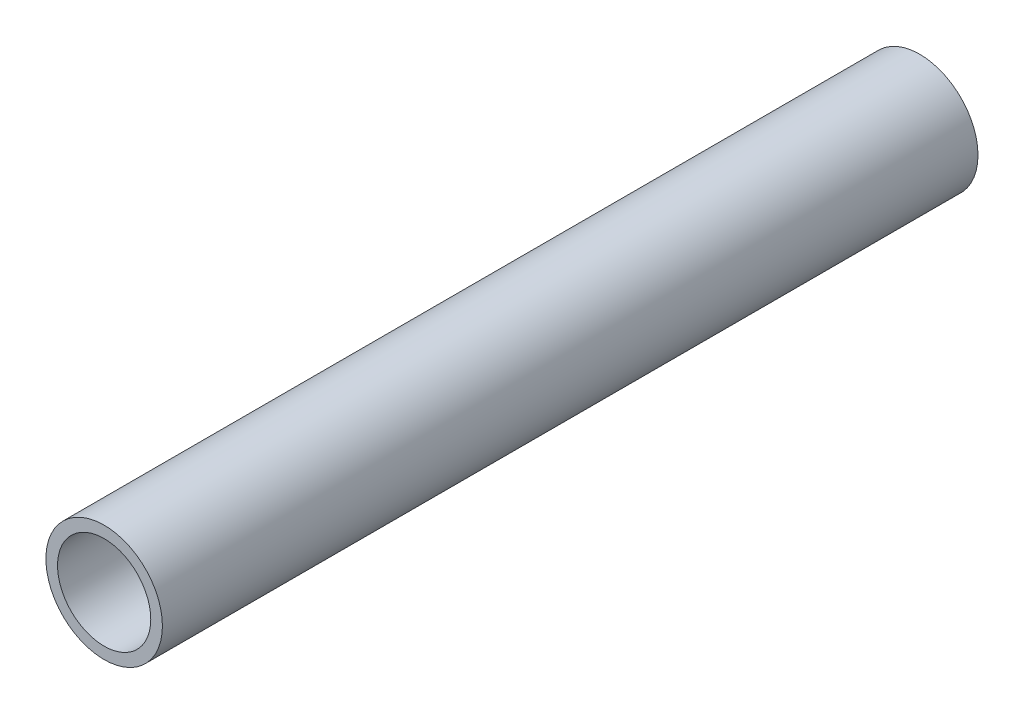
ISO-10303-21;
HEADER;
FILE_DESCRIPTION(('STEP AP214'),'2;1');
FILE_NAME('part.step','',(''),(''),'','','');
FILE_SCHEMA(('AUTOMOTIVE_DESIGN { 1 0 10303 214 1 1 1 1 }'));
ENDSEC;
DATA;
#1=APPLICATION_CONTEXT('core data for automotive mechanical design processes');
#2=APPLICATION_PROTOCOL_DEFINITION('international standard','automotive_design',2000,#1);
#3=PRODUCT_CONTEXT('',#1,'mechanical');
#4=PRODUCT('Part','Part','',(#3));
#5=PRODUCT_RELATED_PRODUCT_CATEGORY('part','',(#4));
#6=PRODUCT_DEFINITION_FORMATION('','',#4);
#7=PRODUCT_DEFINITION_CONTEXT('part definition',#1,'design');
#8=PRODUCT_DEFINITION('design','',#6,#7);
#9=PRODUCT_DEFINITION_SHAPE('','',#8);
#10=(LENGTH_UNIT() NAMED_UNIT(*) SI_UNIT(.MILLI.,.METRE.));
#11=(NAMED_UNIT(*) PLANE_ANGLE_UNIT() SI_UNIT($,.RADIAN.));
#12=(NAMED_UNIT(*) SI_UNIT($,.STERADIAN.) SOLID_ANGLE_UNIT());
#13=UNCERTAINTY_MEASURE_WITH_UNIT(LENGTH_MEASURE(1.E-05),#10,'distance_accuracy_value','');
#14=(GEOMETRIC_REPRESENTATION_CONTEXT(3) GLOBAL_UNCERTAINTY_ASSIGNED_CONTEXT((#13)) GLOBAL_UNIT_ASSIGNED_CONTEXT((#10,
#11,#12)) REPRESENTATION_CONTEXT('',''));
#15=CARTESIAN_POINT('',(0.,0.,0.));
#16=DIRECTION('',(0.,0.,1.));
#17=DIRECTION('',(1.,0.,0.));
#18=AXIS2_PLACEMENT_3D('',#15,#16,#17);
#19=CARTESIAN_POINT('',(0.,0.,22.225));
#20=DIRECTION('',(0.,0.,1.));
#21=DIRECTION('',(1.,0.,0.));
#22=AXIS2_PLACEMENT_3D('',#19,#20,#21);
#23=PLANE('',#22);
#24=CARTESIAN_POINT('',(0.,0.,22.225));
#25=DIRECTION('',(0.,0.,1.));
#26=DIRECTION('',(1.,0.,0.));
#27=AXIS2_PLACEMENT_3D('',#24,#25,#26);
#28=CIRCLE('',#27,3.175);
#29=CARTESIAN_POINT('',(3.175,0.,22.225));
#30=VERTEX_POINT('',#29);
#31=EDGE_CURVE('E10',#30,#30,#28,.T.);
#32=ORIENTED_EDGE('',*,*,#31,.T.);
#33=EDGE_LOOP('',(#32));
#34=FACE_BOUND('',#33,.T.);
#35=CARTESIAN_POINT('',(0.,0.,22.225));
#36=DIRECTION('',(0.,0.,1.));
#37=DIRECTION('',(1.,0.,0.));
#38=AXIS2_PLACEMENT_3D('',#35,#36,#37);
#39=CIRCLE('',#38,2.54);
#40=CARTESIAN_POINT('',(2.54,0.,22.225));
#41=VERTEX_POINT('',#40);
#42=EDGE_CURVE('E46',#41,#41,#39,.T.);
#43=ORIENTED_EDGE('',*,*,#42,.F.);
#44=EDGE_LOOP('',(#43));
#45=FACE_BOUND('',#44,.T.);
#46=ADVANCED_FACE('F35',(#34,#45),#23,.T.);
#47=CARTESIAN_POINT('',(0.,0.,-22.225));
#48=DIRECTION('',(0.,0.,1.));
#49=DIRECTION('',(1.,0.,0.));
#50=AXIS2_PLACEMENT_3D('',#47,#48,#49);
#51=PLANE('',#50);
#52=CARTESIAN_POINT('',(0.,0.,-22.225));
#53=DIRECTION('',(0.,0.,1.));
#54=DIRECTION('',(1.,0.,0.));
#55=AXIS2_PLACEMENT_3D('',#52,#53,#54);
#56=CIRCLE('',#55,3.175);
#57=CARTESIAN_POINT('',(3.175,0.,-22.225));
#58=VERTEX_POINT('',#57);
#59=EDGE_CURVE('E39',#58,#58,#56,.T.);
#60=ORIENTED_EDGE('',*,*,#59,.F.);
#61=EDGE_LOOP('',(#60));
#62=FACE_BOUND('',#61,.T.);
#63=CARTESIAN_POINT('',(0.,0.,-22.225));
#64=DIRECTION('',(0.,0.,1.));
#65=DIRECTION('',(1.,0.,0.));
#66=AXIS2_PLACEMENT_3D('',#63,#64,#65);
#67=CIRCLE('',#66,2.54);
#68=CARTESIAN_POINT('',(2.54,0.,-22.225));
#69=VERTEX_POINT('',#68);
#70=EDGE_CURVE('E48',#69,#69,#67,.T.);
#71=ORIENTED_EDGE('',*,*,#70,.T.);
#72=EDGE_LOOP('',(#71));
#73=FACE_BOUND('',#72,.T.);
#74=ADVANCED_FACE('F58',(#62,#73),#51,.F.);
#75=CARTESIAN_POINT('',(0.,0.,22.225));
#76=DIRECTION('',(0.,0.,-1.));
#77=DIRECTION('',(-1.,0.,0.));
#78=AXIS2_PLACEMENT_3D('',#75,#76,#77);
#79=CYLINDRICAL_SURFACE('',#78,3.175);
#80=ORIENTED_EDGE('',*,*,#31,.F.);
#81=EDGE_LOOP('',(#80));
#82=FACE_BOUND('',#81,.T.);
#83=ORIENTED_EDGE('',*,*,#59,.T.);
#84=EDGE_LOOP('',(#83));
#85=FACE_BOUND('',#84,.T.);
#86=ADVANCED_FACE('F37',(#82,#85),#79,.T.);
#87=CARTESIAN_POINT('',(0.,0.,22.225));
#88=DIRECTION('',(0.,0.,-1.));
#89=DIRECTION('',(-1.,0.,0.));
#90=AXIS2_PLACEMENT_3D('',#87,#88,#89);
#91=CYLINDRICAL_SURFACE('',#90,2.54);
#92=ORIENTED_EDGE('',*,*,#42,.T.);
#93=EDGE_LOOP('',(#92));
#94=FACE_BOUND('',#93,.T.);
#95=ORIENTED_EDGE('',*,*,#70,.F.);
#96=EDGE_LOOP('',(#95));
#97=FACE_BOUND('',#96,.T.);
#98=ADVANCED_FACE('F54',(#94,#97),#91,.F.);
#99=CLOSED_SHELL('',(#46,#74,#86,#98));
#100=MANIFOLD_SOLID_BREP('B2',#99);
#101=ADVANCED_BREP_SHAPE_REPRESENTATION('',(#18,#100),#14);
#102=SHAPE_DEFINITION_REPRESENTATION(#9,#101);
ENDSEC;
END-ISO-10303-21;
